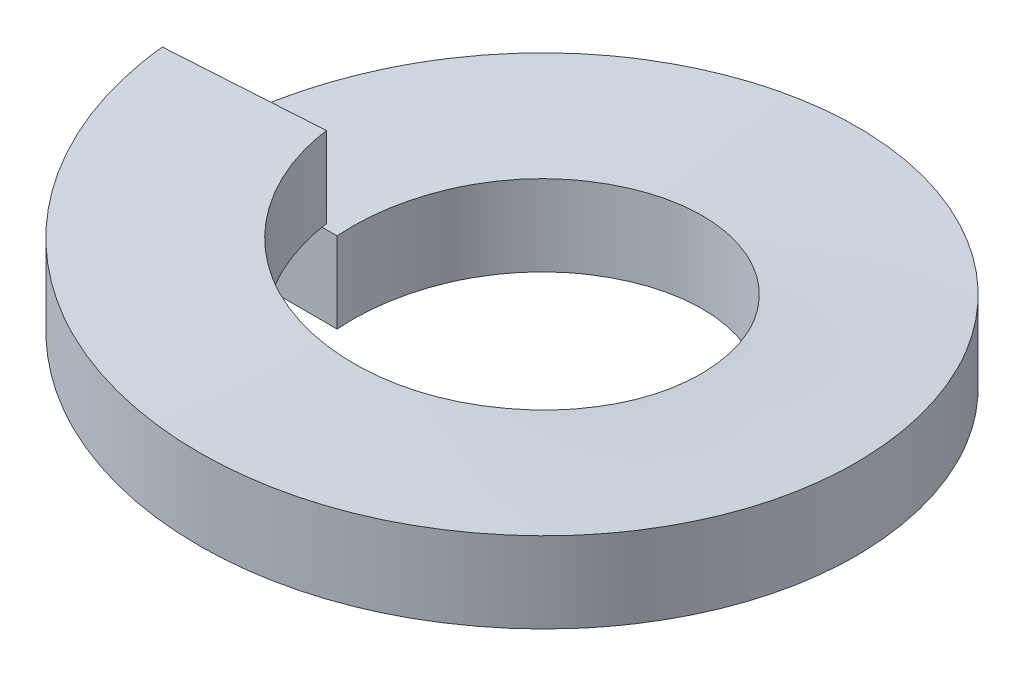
ISO-10303-21;
HEADER;
FILE_DESCRIPTION(('STEP AP214'),'2;1');
FILE_NAME('part.step','',(''),(''),'','','');
FILE_SCHEMA(('AUTOMOTIVE_DESIGN { 1 0 10303 214 1 1 1 1 }'));
ENDSEC;
DATA;
#1=APPLICATION_CONTEXT('core data for automotive mechanical design processes');
#2=APPLICATION_PROTOCOL_DEFINITION('international standard','automotive_design',2000,#1);
#3=PRODUCT_CONTEXT('',#1,'mechanical');
#4=PRODUCT('Part','Part','',(#3));
#5=PRODUCT_RELATED_PRODUCT_CATEGORY('part','',(#4));
#6=PRODUCT_DEFINITION_FORMATION('','',#4);
#7=PRODUCT_DEFINITION_CONTEXT('part definition',#1,'design');
#8=PRODUCT_DEFINITION('design','',#6,#7);
#9=PRODUCT_DEFINITION_SHAPE('','',#8);
#10=(LENGTH_UNIT() NAMED_UNIT(*) SI_UNIT(.MILLI.,.METRE.));
#11=(NAMED_UNIT(*) PLANE_ANGLE_UNIT() SI_UNIT($,.RADIAN.));
#12=(NAMED_UNIT(*) SI_UNIT($,.STERADIAN.) SOLID_ANGLE_UNIT());
#13=UNCERTAINTY_MEASURE_WITH_UNIT(LENGTH_MEASURE(1.E-05),#10,'distance_accuracy_value','');
#14=(GEOMETRIC_REPRESENTATION_CONTEXT(3) GLOBAL_UNCERTAINTY_ASSIGNED_CONTEXT((#13)) GLOBAL_UNIT_ASSIGNED_CONTEXT((#10,
#11,#12)) REPRESENTATION_CONTEXT('',''));
#15=CARTESIAN_POINT('',(0.,0.,0.));
#16=DIRECTION('',(0.,0.,1.));
#17=DIRECTION('',(1.,0.,0.));
#18=AXIS2_PLACEMENT_3D('',#15,#16,#17);
#19=CARTESIAN_POINT('',(-6.22299999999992,-2.22044604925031E-13,-8.88178419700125E-13));
#20=DIRECTION('',(0.,0.,1.00000000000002));
#21=DIRECTION('',(1.00000000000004,0.,0.));
#22=AXIS2_PLACEMENT_3D('',#19,#20,#21);
#23=PLANE('',#22);
#24=DIRECTION('',(0.,-1.,0.));
#25=VECTOR('',#24,1.);
#26=CARTESIAN_POINT('',(-6.22300000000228,1.52399999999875,-1.55431223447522E-12));
#27=LINE('',#26,#25);
#28=CARTESIAN_POINT('',(-6.22300000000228,1.52399999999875,-1.55431223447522E-12));
#29=VERTEX_POINT('',#28);
#30=CARTESIAN_POINT('',(-6.22299999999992,-2.22044604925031E-13,-8.88178419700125E-13));
#31=VERTEX_POINT('',#30);
#32=EDGE_CURVE('E86',#29,#31,#27,.T.);
#33=ORIENTED_EDGE('',*,*,#32,.T.);
#34=DIRECTION('',(1.00000000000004,0.,0.));
#35=VECTOR('',#34,1.);
#36=CARTESIAN_POINT('',(-6.22299999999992,-2.22044604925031E-13,-8.88178419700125E-13));
#37=LINE('',#36,#35);
#38=CARTESIAN_POINT('',(-3.30199999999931,-1.33226762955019E-12,-2.94209101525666E-12));
#39=VERTEX_POINT('',#38);
#40=EDGE_CURVE('E79',#31,#39,#37,.T.);
#41=ORIENTED_EDGE('',*,*,#40,.T.);
#42=DIRECTION('',(0.,1.,0.));
#43=VECTOR('',#42,1.);
#44=CARTESIAN_POINT('',(-3.30200000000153,1.52399999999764,-1.33226762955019E-12));
#45=LINE('',#44,#43);
#46=CARTESIAN_POINT('',(-3.30200000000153,1.52399999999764,-1.33226762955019E-12));
#47=VERTEX_POINT('',#46);
#48=EDGE_CURVE('E74',#39,#47,#45,.T.);
#49=ORIENTED_EDGE('',*,*,#48,.T.);
#50=DIRECTION('',(-1.00000000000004,0.,0.));
#51=VECTOR('',#50,1.);
#52=CARTESIAN_POINT('',(-6.22300000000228,1.52399999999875,-1.55431223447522E-12));
#53=LINE('',#52,#51);
#54=EDGE_CURVE('E69',#47,#29,#53,.T.);
#55=ORIENTED_EDGE('',*,*,#54,.T.);
#56=EDGE_LOOP('',(#33,#41,#49,#55));
#57=FACE_BOUND('',#56,.T.);
#58=ADVANCED_FACE('F34',(#57),#23,.T.);
#59=CARTESIAN_POINT('',(-6.2107203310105,1.82879999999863,0.390745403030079));
#60=DIRECTION('',(0.0627905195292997,0.,0.998026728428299));
#61=DIRECTION('',(0.998026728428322,0.,-0.0627905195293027));
#62=AXIS2_PLACEMENT_3D('',#59,#60,#61);
#63=PLANE('',#62);
#64=DIRECTION('',(0.,-1.,0.));
#65=VECTOR('',#64,1.);
#66=CARTESIAN_POINT('',(-6.21072033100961,3.35279999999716,0.390745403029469));
#67=LINE('',#66,#65);
#68=CARTESIAN_POINT('',(-6.21072033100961,3.35279999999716,0.390745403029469));
#69=VERTEX_POINT('',#68);
#70=CARTESIAN_POINT('',(-6.2107203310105,1.82879999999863,0.390745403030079));
#71=VERTEX_POINT('',#70);
#72=EDGE_CURVE('E94',#69,#71,#67,.T.);
#73=ORIENTED_EDGE('',*,*,#72,.F.);
#74=DIRECTION('',(-0.998026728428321,0.,0.0627905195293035));
#75=VECTOR('',#74,1.);
#76=CARTESIAN_POINT('',(-6.21072033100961,3.35279999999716,0.390745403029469));
#77=LINE('',#76,#75);
#78=CARTESIAN_POINT('',(-3.29548425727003,3.35279999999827,0.207334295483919));
#79=VERTEX_POINT('',#78);
#80=EDGE_CURVE('E11',#79,#69,#77,.T.);
#81=ORIENTED_EDGE('',*,*,#80,.F.);
#82=DIRECTION('',(0.,1.,0.));
#83=VECTOR('',#82,1.);
#84=CARTESIAN_POINT('',(-3.29548425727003,3.35279999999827,0.207334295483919));
#85=LINE('',#84,#83);
#86=CARTESIAN_POINT('',(-3.29548425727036,1.82879999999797,0.207334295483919));
#87=VERTEX_POINT('',#86);
#88=EDGE_CURVE('E48',#87,#79,#85,.T.);
#89=ORIENTED_EDGE('',*,*,#88,.F.);
#90=DIRECTION('',(0.998026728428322,0.,-0.0627905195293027));
#91=VECTOR('',#90,1.);
#92=CARTESIAN_POINT('',(-6.2107203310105,1.82879999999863,0.390745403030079));
#93=LINE('',#92,#91);
#94=EDGE_CURVE('E57',#71,#87,#93,.T.);
#95=ORIENTED_EDGE('',*,*,#94,.F.);
#96=EDGE_LOOP('',(#73,#81,#89,#95));
#97=FACE_BOUND('',#96,.T.);
#98=ADVANCED_FACE('F140',(#97),#63,.F.);
#99=CARTESIAN_POINT('',(0.,0.,0.));
#100=DIRECTION('',(0.,1.,0.));
#101=DIRECTION('',(0.,0.,1.00000000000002));
#102=AXIS2_PLACEMENT_3D('',#99,#100,#101);
#103=CYLINDRICAL_SURFACE('',#102,6.223);
#104=CARTESIAN_POINT('',(-6.22299999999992,-2.22044604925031E-13,-8.88178419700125E-13));
#105=CARTESIAN_POINT('',(-6.22299999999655,0.152400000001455,-3.54953653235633));
#106=CARTESIAN_POINT('',(-3.16776473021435,0.304799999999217,-5.35639763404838));
#107=CARTESIAN_POINT('',(-0.112529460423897,0.457200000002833,-7.16325873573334));
#108=CARTESIAN_POINT('',(2.99795311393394,0.609600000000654,-5.45325646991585));
#109=CARTESIAN_POINT('',(6.10843568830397,0.762000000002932,-3.74325420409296));
#110=CARTESIAN_POINT('',(6.21992932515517,0.914399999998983,-0.195469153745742));
#111=CARTESIAN_POINT('',(6.33142296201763,1.06680000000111,3.35231589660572));
#112=CARTESIAN_POINT('',(3.33445014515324,1.21920000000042,5.25425268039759));
#113=CARTESIAN_POINT('',(0.33747732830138,1.37160000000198,7.15618946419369));
#114=CARTESIAN_POINT('',(-2.82518287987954,1.52399999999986,5.54473360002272));
#115=CARTESIAN_POINT('',(-5.98784308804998,1.6764000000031,3.9332777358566));
#116=CARTESIAN_POINT('',(-6.2107203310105,1.82879999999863,0.390745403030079));
#117=(BOUNDED_CURVE() B_SPLINE_CURVE(2,(#104,#105,#106,#107,#108,#109,#110,#111,#112,#113,#114,
#115,#116),.UNSPECIFIED.,.F.,.F.) B_SPLINE_CURVE_WITH_KNOTS((3,2,2,2,2,2,3),(0.,
0.166666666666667,0.333333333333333,0.5,0.666666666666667,0.833333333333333,1.),
.UNSPECIFIED.) CURVE() GEOMETRIC_REPRESENTATION_ITEM() RATIONAL_B_SPLINE_CURVE((1.,
0.868631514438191,1.,0.868631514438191,1.,0.868631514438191,1.,0.868631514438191,1.,
0.868631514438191,1.,0.868631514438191,1.)) REPRESENTATION_ITEM(''));
#118=EDGE_CURVE('E89',#31,#71,#117,.T.);
#119=ORIENTED_EDGE('',*,*,#118,.F.);
#120=ORIENTED_EDGE('',*,*,#32,.F.);
#121=CARTESIAN_POINT('',(-6.22300000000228,1.52399999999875,-1.55431223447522E-12));
#122=CARTESIAN_POINT('',(-6.22299999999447,1.67640000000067,-3.54953653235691));
#123=CARTESIAN_POINT('',(-3.16776473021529,1.82879999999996,-5.35639763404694));
#124=CARTESIAN_POINT('',(-0.112529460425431,1.98120000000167,-7.16325873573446));
#125=CARTESIAN_POINT('',(2.99795311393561,2.1335999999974,-5.45325646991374));
#126=CARTESIAN_POINT('',(6.10843568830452,2.28600000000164,-3.74325420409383));
#127=CARTESIAN_POINT('',(6.21992932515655,2.43839999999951,-0.195469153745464));
#128=CARTESIAN_POINT('',(6.33142296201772,2.5908000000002,3.35231589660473));
#129=CARTESIAN_POINT('',(3.33445014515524,2.74319999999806,5.25425268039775));
#130=CARTESIAN_POINT('',(0.337477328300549,2.89560000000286,7.15618946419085));
#131=CARTESIAN_POINT('',(-2.82518287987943,3.04799999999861,5.54473360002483));
#132=CARTESIAN_POINT('',(-5.98784308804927,3.20040000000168,3.9332777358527));
#133=CARTESIAN_POINT('',(-6.21072033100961,3.35279999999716,0.390745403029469));
#134=(BOUNDED_CURVE() B_SPLINE_CURVE(2,(#121,#122,#123,#124,#125,#126,#127,#128,#129,#130,#131,
#132,#133),.UNSPECIFIED.,.F.,.F.) B_SPLINE_CURVE_WITH_KNOTS((3,2,2,2,2,2,3),(0.,
0.166666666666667,0.333333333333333,0.5,0.666666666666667,0.833333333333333,1.),
.UNSPECIFIED.) CURVE() GEOMETRIC_REPRESENTATION_ITEM() RATIONAL_B_SPLINE_CURVE((1.,
0.868631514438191,1.,0.868631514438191,1.,0.868631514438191,1.,0.868631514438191,1.,
0.868631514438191,1.,0.868631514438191,1.)) REPRESENTATION_ITEM(''));
#135=EDGE_CURVE('E88',#29,#69,#134,.T.);
#136=ORIENTED_EDGE('',*,*,#135,.T.);
#137=ORIENTED_EDGE('',*,*,#72,.T.);
#138=EDGE_LOOP('',(#119,#120,#136,#137));
#139=FACE_BOUND('',#138,.T.);
#140=ADVANCED_FACE('F87',(#139),#103,.T.);
#141=CARTESIAN_POINT('',(-6.22299999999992,-2.22044604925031E-13,-8.88178419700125E-13));
#142=CARTESIAN_POINT('',(-6.22299999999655,0.152400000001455,-3.54953653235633));
#143=CARTESIAN_POINT('',(-3.16776473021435,0.304799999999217,-5.35639763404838));
#144=CARTESIAN_POINT('',(-0.112529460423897,0.457200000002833,-7.16325873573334));
#145=CARTESIAN_POINT('',(2.99795311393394,0.609600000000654,-5.45325646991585));
#146=CARTESIAN_POINT('',(6.10843568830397,0.762000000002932,-3.74325420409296));
#147=CARTESIAN_POINT('',(6.21992932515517,0.914399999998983,-0.195469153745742));
#148=CARTESIAN_POINT('',(6.33142296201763,1.06680000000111,3.35231589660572));
#149=CARTESIAN_POINT('',(3.33445014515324,1.21920000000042,5.25425268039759));
#150=CARTESIAN_POINT('',(0.33747732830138,1.37160000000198,7.15618946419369));
#151=CARTESIAN_POINT('',(-2.82518287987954,1.52399999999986,5.54473360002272));
#152=CARTESIAN_POINT('',(-5.98784308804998,1.6764000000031,3.9332777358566));
#153=CARTESIAN_POINT('',(-6.2107203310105,1.82879999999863,0.390745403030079));
#154=CARTESIAN_POINT('',(-3.30199999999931,-1.33226762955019E-12,-2.94209101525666E-12));
#155=CARTESIAN_POINT('',(-3.30199999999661,0.152400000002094,-1.88342754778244));
#156=CARTESIAN_POINT('',(-1.68085475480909,0.304800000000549,-2.84217017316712));
#157=CARTESIAN_POINT('',(-0.0597095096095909,0.457200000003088,-3.80091279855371));
#158=CARTESIAN_POINT('',(1.5907506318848,0.609599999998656,-2.89356465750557));
#159=CARTESIAN_POINT('',(3.2412107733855,0.762000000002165,-1.98621651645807));
#160=CARTESIAN_POINT('',(3.300370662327,0.914399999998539,-0.103718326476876));
#161=CARTESIAN_POINT('',(3.359530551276,1.06679999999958,1.77877986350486));
#162=CARTESIAN_POINT('',(1.76930007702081,1.21919999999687,2.78797081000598));
#163=CARTESIAN_POINT('',(0.179069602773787,1.3716000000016,3.79716175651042));
#164=CARTESIAN_POINT('',(-1.49907663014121,1.52399999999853,2.94210354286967));
#165=CARTESIAN_POINT('',(-3.177222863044,1.67640000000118,2.08704532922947));
#166=CARTESIAN_POINT('',(-3.29548425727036,1.82879999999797,0.207334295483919));
#167=(BOUNDED_SURFACE() B_SPLINE_SURFACE(1,2,((#141,#142,#143,#144,#145,#146,#147,#148,#149,
#150,#151,#152,#153),(#154,#155,#156,#157,#158,#159,#160,#161,#162,#163,#164,#165,#166)),
.UNSPECIFIED.,.F.,.F.,.F.) B_SPLINE_SURFACE_WITH_KNOTS((2,2),(3,2,2,2,2,2,3),(0.,1.),(0.,
0.166666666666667,0.333333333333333,0.5,0.666666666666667,0.833333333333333,1.),
.UNSPECIFIED.) GEOMETRIC_REPRESENTATION_ITEM() RATIONAL_B_SPLINE_SURFACE(((1.,0.868631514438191,
1.,0.868631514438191,1.,0.868631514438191,1.,0.868631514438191,1.,0.868631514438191,1.,
0.868631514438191,1.),(1.,0.868631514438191,1.,0.868631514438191,1.,0.868631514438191,1.,
0.868631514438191,1.,0.868631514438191,1.,0.868631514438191,1.))) REPRESENTATION_ITEM('') SURFACE());
#168=CARTESIAN_POINT('',(-3.30199999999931,-1.33226762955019E-12,-2.94209101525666E-12));
#169=CARTESIAN_POINT('',(-3.30199999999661,0.152400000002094,-1.88342754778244));
#170=CARTESIAN_POINT('',(-1.68085475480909,0.304800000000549,-2.84217017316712));
#171=CARTESIAN_POINT('',(-0.0597095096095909,0.457200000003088,-3.80091279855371));
#172=CARTESIAN_POINT('',(1.5907506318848,0.609599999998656,-2.89356465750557));
#173=CARTESIAN_POINT('',(3.2412107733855,0.762000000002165,-1.98621651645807));
#174=CARTESIAN_POINT('',(3.300370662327,0.914399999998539,-0.103718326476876));
#175=CARTESIAN_POINT('',(3.359530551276,1.06679999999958,1.77877986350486));
#176=CARTESIAN_POINT('',(1.76930007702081,1.21919999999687,2.78797081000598));
#177=CARTESIAN_POINT('',(0.179069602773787,1.3716000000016,3.79716175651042));
#178=CARTESIAN_POINT('',(-1.49907663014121,1.52399999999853,2.94210354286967));
#179=CARTESIAN_POINT('',(-3.177222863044,1.67640000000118,2.08704532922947));
#180=CARTESIAN_POINT('',(-3.29548425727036,1.82879999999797,0.207334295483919));
#181=(BOUNDED_CURVE() B_SPLINE_CURVE(2,(#168,#169,#170,#171,#172,#173,#174,#175,#176,#177,#178,
#179,#180),.UNSPECIFIED.,.F.,.F.) B_SPLINE_CURVE_WITH_KNOTS((3,2,2,2,2,2,3),(0.,
0.166666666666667,0.333333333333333,0.5,0.666666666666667,0.833333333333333,1.),
.UNSPECIFIED.) CURVE() GEOMETRIC_REPRESENTATION_ITEM() RATIONAL_B_SPLINE_CURVE((1.,
0.868631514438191,1.,0.868631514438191,1.,0.868631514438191,1.,0.868631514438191,1.,
0.868631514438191,1.,0.868631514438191,1.)) REPRESENTATION_ITEM(''));
#182=EDGE_CURVE('E109',#39,#87,#181,.T.);
#183=ORIENTED_EDGE('',*,*,#182,.F.);
#184=ORIENTED_EDGE('',*,*,#40,.F.);
#185=ORIENTED_EDGE('',*,*,#118,.T.);
#186=ORIENTED_EDGE('',*,*,#94,.T.);
#187=EDGE_LOOP('',(#183,#184,#185,#186));
#188=FACE_BOUND('',#187,.T.);
#189=ADVANCED_FACE('F127',(#188),#167,.F.);
#190=CARTESIAN_POINT('',(0.,0.,0.));
#191=DIRECTION('',(0.,1.,0.));
#192=DIRECTION('',(0.,0.,1.00000000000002));
#193=AXIS2_PLACEMENT_3D('',#190,#191,#192);
#194=CYLINDRICAL_SURFACE('',#193,3.302);
#195=CARTESIAN_POINT('',(-3.30200000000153,1.52399999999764,-1.33226762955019E-12));
#196=CARTESIAN_POINT('',(-3.30199999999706,1.67640000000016,-1.88342754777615));
#197=CARTESIAN_POINT('',(-1.68085475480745,1.82879999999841,-2.84217017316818));
#198=CARTESIAN_POINT('',(-0.0597095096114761,1.98119999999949,-3.80091279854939));
#199=CARTESIAN_POINT('',(1.59075063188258,2.13359999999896,-2.89356465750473));
#200=CARTESIAN_POINT('',(3.2412107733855,2.28600000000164,-1.98621651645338));
#201=CARTESIAN_POINT('',(3.30037066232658,2.43839999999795,-0.10371832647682));
#202=CARTESIAN_POINT('',(3.35953055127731,2.59079999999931,1.77877986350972));
#203=CARTESIAN_POINT('',(1.76930007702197,2.74319999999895,2.78797081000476));
#204=CARTESIAN_POINT('',(0.179069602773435,2.89559999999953,3.79716175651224));
#205=CARTESIAN_POINT('',(-1.49907663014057,3.04799999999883,2.94210354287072));
#206=CARTESIAN_POINT('',(-3.17722286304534,3.2004000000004,2.08704532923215));
#207=CARTESIAN_POINT('',(-3.29548425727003,3.35279999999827,0.207334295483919));
#208=(BOUNDED_CURVE() B_SPLINE_CURVE(2,(#195,#196,#197,#198,#199,#200,#201,#202,#203,#204,#205,
#206,#207),.UNSPECIFIED.,.F.,.F.) B_SPLINE_CURVE_WITH_KNOTS((3,2,2,2,2,2,3),(0.,
0.166666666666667,0.333333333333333,0.5,0.666666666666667,0.833333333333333,1.),
.UNSPECIFIED.) CURVE() GEOMETRIC_REPRESENTATION_ITEM() RATIONAL_B_SPLINE_CURVE((1.,
0.868631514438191,1.,0.868631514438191,1.,0.868631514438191,1.,0.868631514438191,1.,
0.868631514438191,1.,0.868631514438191,1.)) REPRESENTATION_ITEM(''));
#209=EDGE_CURVE('E41',#47,#79,#208,.T.);
#210=ORIENTED_EDGE('',*,*,#209,.F.);
#211=ORIENTED_EDGE('',*,*,#48,.F.);
#212=ORIENTED_EDGE('',*,*,#182,.T.);
#213=ORIENTED_EDGE('',*,*,#88,.T.);
#214=EDGE_LOOP('',(#210,#211,#212,#213));
#215=FACE_BOUND('',#214,.T.);
#216=ADVANCED_FACE('F125',(#215),#194,.F.);
#217=CARTESIAN_POINT('',(-3.30200000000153,1.52399999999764,-1.33226762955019E-12));
#218=CARTESIAN_POINT('',(-3.30199999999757,1.67640000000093,-1.88342754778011));
#219=CARTESIAN_POINT('',(-1.68085475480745,1.82879999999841,-2.84217017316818));
#220=CARTESIAN_POINT('',(-0.0597095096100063,1.9812000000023,-3.80091279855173));
#221=CARTESIAN_POINT('',(1.59075063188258,2.13359999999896,-2.89356465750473));
#222=CARTESIAN_POINT('',(3.24121077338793,2.28600000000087,-1.98621651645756));
#223=CARTESIAN_POINT('',(3.30037066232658,2.43839999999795,-0.10371832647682));
#224=CARTESIAN_POINT('',(3.3595305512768,2.59080000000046,1.77877986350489));
#225=CARTESIAN_POINT('',(1.76930007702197,2.74319999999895,2.78797081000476));
#226=CARTESIAN_POINT('',(0.179069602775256,2.89560000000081,3.7971617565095));
#227=CARTESIAN_POINT('',(-1.49907663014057,3.04799999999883,2.94210354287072));
#228=CARTESIAN_POINT('',(-3.17722286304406,3.20040000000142,2.08704532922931));
#229=CARTESIAN_POINT('',(-3.29548425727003,3.35279999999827,0.207334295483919));
#230=CARTESIAN_POINT('',(-6.22300000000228,1.52399999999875,-1.55431223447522E-12));
#231=CARTESIAN_POINT('',(-6.22299999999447,1.67640000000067,-3.54953653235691));
#232=CARTESIAN_POINT('',(-3.16776473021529,1.82879999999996,-5.35639763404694));
#233=CARTESIAN_POINT('',(-0.112529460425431,1.98120000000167,-7.16325873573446));
#234=CARTESIAN_POINT('',(2.99795311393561,2.1335999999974,-5.45325646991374));
#235=CARTESIAN_POINT('',(6.10843568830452,2.28600000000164,-3.74325420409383));
#236=CARTESIAN_POINT('',(6.21992932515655,2.43839999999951,-0.195469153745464));
#237=CARTESIAN_POINT('',(6.33142296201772,2.5908000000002,3.35231589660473));
#238=CARTESIAN_POINT('',(3.33445014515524,2.74319999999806,5.25425268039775));
#239=CARTESIAN_POINT('',(0.337477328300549,2.89560000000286,7.15618946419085));
#240=CARTESIAN_POINT('',(-2.82518287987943,3.04799999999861,5.54473360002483));
#241=CARTESIAN_POINT('',(-5.98784308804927,3.20040000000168,3.9332777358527));
#242=CARTESIAN_POINT('',(-6.21072033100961,3.35279999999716,0.390745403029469));
#243=(BOUNDED_SURFACE() B_SPLINE_SURFACE(1,2,((#217,#218,#219,#220,#221,#222,#223,#224,#225,
#226,#227,#228,#229),(#230,#231,#232,#233,#234,#235,#236,#237,#238,#239,#240,#241,#242)),
.UNSPECIFIED.,.F.,.F.,.F.) B_SPLINE_SURFACE_WITH_KNOTS((2,2),(3,2,2,2,2,2,3),(0.,1.),(0.,
0.166666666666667,0.333333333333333,0.5,0.666666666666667,0.833333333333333,1.),
.UNSPECIFIED.) GEOMETRIC_REPRESENTATION_ITEM() RATIONAL_B_SPLINE_SURFACE(((1.,0.868631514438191,
1.,0.868631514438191,1.,0.868631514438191,1.,0.868631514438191,1.,0.868631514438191,1.,
0.868631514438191,1.),(1.,0.868631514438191,1.,0.868631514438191,1.,0.868631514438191,1.,
0.868631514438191,1.,0.868631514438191,1.,0.868631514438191,1.))) REPRESENTATION_ITEM('') SURFACE());
#244=ORIENTED_EDGE('',*,*,#80,.T.);
#245=ORIENTED_EDGE('',*,*,#135,.F.);
#246=ORIENTED_EDGE('',*,*,#54,.F.);
#247=ORIENTED_EDGE('',*,*,#209,.T.);
#248=EDGE_LOOP('',(#244,#245,#246,#247));
#249=FACE_BOUND('',#248,.T.);
#250=ADVANCED_FACE('F92',(#249),#243,.F.);
#251=CLOSED_SHELL('',(#58,#98,#140,#189,#216,#250));
#252=MANIFOLD_SOLID_BREP('B2',#251);
#253=ADVANCED_BREP_SHAPE_REPRESENTATION('',(#18,#252),#14);
#254=SHAPE_DEFINITION_REPRESENTATION(#9,#253);
ENDSEC;
END-ISO-10303-21;
